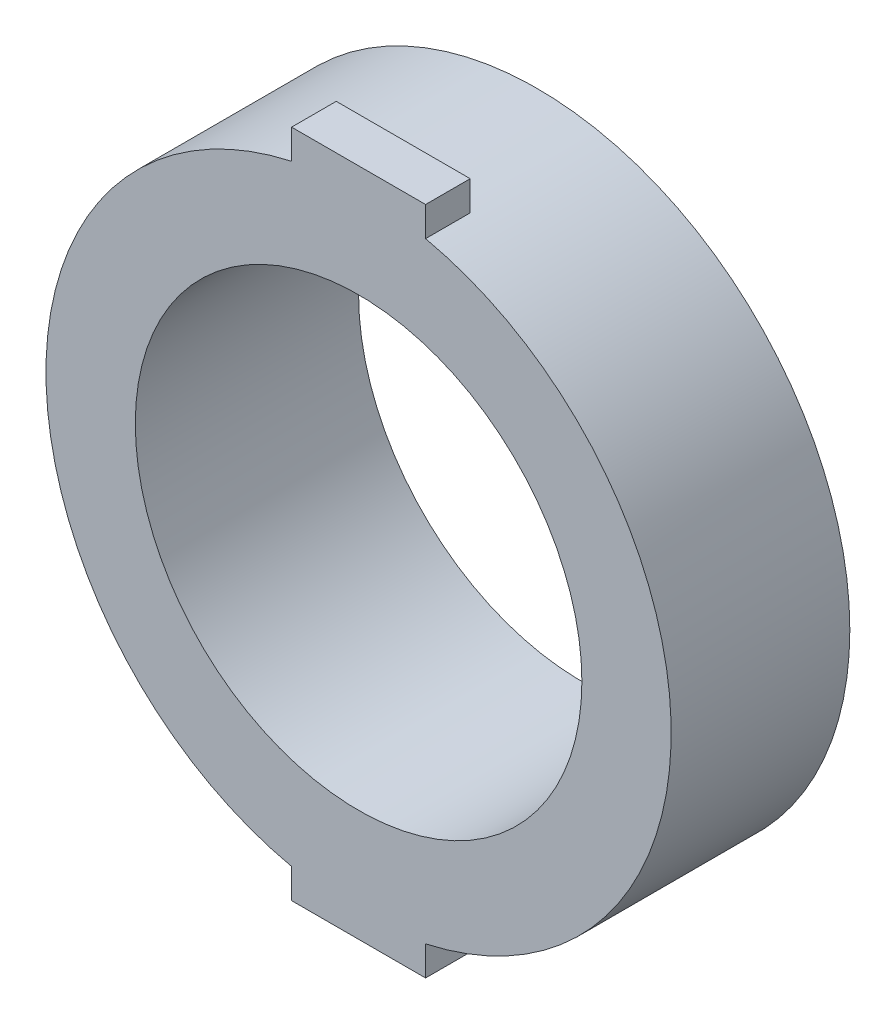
ISO-10303-21;
HEADER;
FILE_DESCRIPTION(('STEP AP214'),'2;1');
FILE_NAME('part.step','',(''),(''),'','','');
FILE_SCHEMA(('AUTOMOTIVE_DESIGN { 1 0 10303 214 1 1 1 1 }'));
ENDSEC;
DATA;
#1=APPLICATION_CONTEXT('core data for automotive mechanical design processes');
#2=APPLICATION_PROTOCOL_DEFINITION('international standard','automotive_design',2000,#1);
#3=PRODUCT_CONTEXT('',#1,'mechanical');
#4=PRODUCT('Part','Part','',(#3));
#5=PRODUCT_RELATED_PRODUCT_CATEGORY('part','',(#4));
#6=PRODUCT_DEFINITION_FORMATION('','',#4);
#7=PRODUCT_DEFINITION_CONTEXT('part definition',#1,'design');
#8=PRODUCT_DEFINITION('design','',#6,#7);
#9=PRODUCT_DEFINITION_SHAPE('','',#8);
#10=(LENGTH_UNIT() NAMED_UNIT(*) SI_UNIT(.MILLI.,.METRE.));
#11=(NAMED_UNIT(*) PLANE_ANGLE_UNIT() SI_UNIT($,.RADIAN.));
#12=(NAMED_UNIT(*) SI_UNIT($,.STERADIAN.) SOLID_ANGLE_UNIT());
#13=UNCERTAINTY_MEASURE_WITH_UNIT(LENGTH_MEASURE(1.E-05),#10,'distance_accuracy_value','');
#14=(GEOMETRIC_REPRESENTATION_CONTEXT(3) GLOBAL_UNCERTAINTY_ASSIGNED_CONTEXT((#13)) GLOBAL_UNIT_ASSIGNED_CONTEXT((#10,
#11,#12)) REPRESENTATION_CONTEXT('',''));
#15=CARTESIAN_POINT('',(0.,0.,0.));
#16=DIRECTION('',(0.,0.,1.));
#17=DIRECTION('',(1.,0.,0.));
#18=AXIS2_PLACEMENT_3D('',#15,#16,#17);
#19=CARTESIAN_POINT('',(0.,0.,0.));
#20=DIRECTION('',(0.,0.,1.));
#21=DIRECTION('',(1.,0.,0.));
#22=AXIS2_PLACEMENT_3D('',#19,#20,#21);
#23=PLANE('',#22);
#24=CARTESIAN_POINT('',(0.,0.,0.));
#25=DIRECTION('',(0.,0.,1.));
#26=DIRECTION('',(1.,0.,0.));
#27=AXIS2_PLACEMENT_3D('',#24,#25,#26);
#28=CIRCLE('',#27,7.);
#29=CARTESIAN_POINT('',(7.,0.,0.));
#30=VERTEX_POINT('',#29);
#31=EDGE_CURVE('E149',#30,#30,#28,.T.);
#32=ORIENTED_EDGE('',*,*,#31,.F.);
#33=EDGE_LOOP('',(#32));
#34=FACE_BOUND('',#33,.T.);
#35=CARTESIAN_POINT('',(0.,0.,0.));
#36=DIRECTION('',(0.,0.,1.));
#37=DIRECTION('',(1.,0.,0.));
#38=AXIS2_PLACEMENT_3D('',#35,#36,#37);
#39=CIRCLE('',#38,5.5);
#40=CARTESIAN_POINT('',(5.5,0.,0.));
#41=VERTEX_POINT('',#40);
#42=EDGE_CURVE('E11',#41,#41,#39,.F.);
#43=ORIENTED_EDGE('',*,*,#42,.F.);
#44=EDGE_LOOP('',(#43));
#45=FACE_BOUND('',#44,.T.);
#46=ADVANCED_FACE('F32',(#34,#45),#23,.F.);
#47=CARTESIAN_POINT('',(0.,0.,4.));
#48=DIRECTION('',(0.,0.,1.));
#49=DIRECTION('',(1.,0.,0.));
#50=AXIS2_PLACEMENT_3D('',#47,#48,#49);
#51=PLANE('',#50);
#52=CARTESIAN_POINT('',(0.,0.,4.));
#53=DIRECTION('',(0.,0.,1.));
#54=DIRECTION('',(1.,0.,0.));
#55=AXIS2_PLACEMENT_3D('',#52,#53,#54);
#56=CIRCLE('',#55,7.);
#57=CARTESIAN_POINT('',(-1.5,6.83739716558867,4.));
#58=VERTEX_POINT('',#57);
#59=CARTESIAN_POINT('',(-1.5,-6.83739716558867,4.));
#60=VERTEX_POINT('',#59);
#61=EDGE_CURVE('E103',#58,#60,#56,.T.);
#62=ORIENTED_EDGE('',*,*,#61,.T.);
#63=DIRECTION('',(0.,-1.,0.));
#64=VECTOR('',#63,1.);
#65=CARTESIAN_POINT('',(-1.5,-7.5,4.));
#66=LINE('',#65,#64);
#67=CARTESIAN_POINT('',(-1.5,-7.5,4.));
#68=VERTEX_POINT('',#67);
#69=EDGE_CURVE('E96',#60,#68,#66,.T.);
#70=ORIENTED_EDGE('',*,*,#69,.T.);
#71=DIRECTION('',(1.,0.,0.));
#72=VECTOR('',#71,1.);
#73=CARTESIAN_POINT('',(-1.5,-7.5,4.));
#74=LINE('',#73,#72);
#75=CARTESIAN_POINT('',(1.5,-7.5,4.));
#76=VERTEX_POINT('',#75);
#77=EDGE_CURVE('E101',#68,#76,#74,.T.);
#78=ORIENTED_EDGE('',*,*,#77,.T.);
#79=DIRECTION('',(0.,1.,0.));
#80=VECTOR('',#79,1.);
#81=CARTESIAN_POINT('',(1.49999999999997,-6.07506881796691,4.));
#82=LINE('',#81,#80);
#83=CARTESIAN_POINT('',(1.49999999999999,-6.83739716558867,4.));
#84=VERTEX_POINT('',#83);
#85=EDGE_CURVE('E47',#76,#84,#82,.T.);
#86=ORIENTED_EDGE('',*,*,#85,.T.);
#87=CARTESIAN_POINT('',(1.50000000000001,6.83739716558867,4.));
#88=VERTEX_POINT('',#87);
#89=EDGE_CURVE('E152',#84,#88,#56,.T.);
#90=ORIENTED_EDGE('',*,*,#89,.T.);
#91=DIRECTION('',(0.,1.,0.));
#92=VECTOR('',#91,1.);
#93=CARTESIAN_POINT('',(1.50000000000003,6.14530082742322,4.));
#94=LINE('',#93,#92);
#95=CARTESIAN_POINT('',(1.5,7.5,4.));
#96=VERTEX_POINT('',#95);
#97=EDGE_CURVE('E131',#88,#96,#94,.T.);
#98=ORIENTED_EDGE('',*,*,#97,.T.);
#99=DIRECTION('',(-1.,0.,0.));
#100=VECTOR('',#99,1.);
#101=CARTESIAN_POINT('',(-1.5,7.5,4.));
#102=LINE('',#101,#100);
#103=CARTESIAN_POINT('',(-1.5,7.5,4.));
#104=VERTEX_POINT('',#103);
#105=EDGE_CURVE('E127',#96,#104,#102,.T.);
#106=ORIENTED_EDGE('',*,*,#105,.T.);
#107=DIRECTION('',(0.,-1.,0.));
#108=VECTOR('',#107,1.);
#109=CARTESIAN_POINT('',(-1.5,7.5,4.));
#110=LINE('',#109,#108);
#111=EDGE_CURVE('E54',#104,#58,#110,.T.);
#112=ORIENTED_EDGE('',*,*,#111,.T.);
#113=EDGE_LOOP('',(#62,#70,#78,#86,#90,#98,#106,#112));
#114=FACE_BOUND('',#113,.T.);
#115=CARTESIAN_POINT('',(0.,0.,4.));
#116=DIRECTION('',(0.,0.,1.));
#117=DIRECTION('',(1.,0.,0.));
#118=AXIS2_PLACEMENT_3D('',#115,#116,#117);
#119=CIRCLE('',#118,5.);
#120=CARTESIAN_POINT('',(5.,0.,4.));
#121=VERTEX_POINT('',#120);
#122=EDGE_CURVE('E145',#121,#121,#119,.T.);
#123=ORIENTED_EDGE('',*,*,#122,.F.);
#124=EDGE_LOOP('',(#123));
#125=FACE_BOUND('',#124,.T.);
#126=ADVANCED_FACE('F98',(#114,#125),#51,.T.);
#127=CARTESIAN_POINT('',(0.,0.,4.));
#128=DIRECTION('',(0.,0.,-1.));
#129=DIRECTION('',(-1.,0.,0.));
#130=AXIS2_PLACEMENT_3D('',#127,#128,#129);
#131=CYLINDRICAL_SURFACE('',#130,7.);
#132=ORIENTED_EDGE('',*,*,#89,.F.);
#133=DIRECTION('',(0.,0.,-1.));
#134=VECTOR('',#133,1.);
#135=CARTESIAN_POINT('',(1.49999999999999,-6.83739716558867,4.));
#136=LINE('',#135,#134);
#137=CARTESIAN_POINT('',(1.49999999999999,-6.83739716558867,3.));
#138=VERTEX_POINT('',#137);
#139=EDGE_CURVE('E40',#84,#138,#136,.T.);
#140=ORIENTED_EDGE('',*,*,#139,.T.);
#141=CARTESIAN_POINT('',(0.,0.,3.));
#142=DIRECTION('',(0.,0.,1.));
#143=DIRECTION('',(1.,0.,0.));
#144=AXIS2_PLACEMENT_3D('',#141,#142,#143);
#145=CIRCLE('',#144,7.);
#146=CARTESIAN_POINT('',(-1.5,-6.83739716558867,3.));
#147=VERTEX_POINT('',#146);
#148=EDGE_CURVE('E163',#147,#138,#145,.T.);
#149=ORIENTED_EDGE('',*,*,#148,.F.);
#150=DIRECTION('',(0.,0.,-1.));
#151=VECTOR('',#150,1.);
#152=CARTESIAN_POINT('',(-1.5,-6.83739716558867,4.));
#153=LINE('',#152,#151);
#154=EDGE_CURVE('E165',#147,#60,#153,.F.);
#155=ORIENTED_EDGE('',*,*,#154,.T.);
#156=ORIENTED_EDGE('',*,*,#61,.F.);
#157=DIRECTION('',(0.,0.,-1.));
#158=VECTOR('',#157,1.);
#159=CARTESIAN_POINT('',(-1.5,6.83739716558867,4.));
#160=LINE('',#159,#158);
#161=CARTESIAN_POINT('',(-1.5,6.83739716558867,3.));
#162=VERTEX_POINT('',#161);
#163=EDGE_CURVE('E157',#58,#162,#160,.T.);
#164=ORIENTED_EDGE('',*,*,#163,.T.);
#165=CARTESIAN_POINT('',(0.,0.,3.));
#166=DIRECTION('',(0.,0.,-1.));
#167=DIRECTION('',(-1.,0.,0.));
#168=AXIS2_PLACEMENT_3D('',#165,#166,#167);
#169=CIRCLE('',#168,7.);
#170=CARTESIAN_POINT('',(1.50000000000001,6.83739716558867,3.));
#171=VERTEX_POINT('',#170);
#172=EDGE_CURVE('E154',#162,#171,#169,.T.);
#173=ORIENTED_EDGE('',*,*,#172,.T.);
#174=DIRECTION('',(0.,0.,-1.));
#175=VECTOR('',#174,1.);
#176=CARTESIAN_POINT('',(1.50000000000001,6.83739716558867,4.));
#177=LINE('',#176,#175);
#178=EDGE_CURVE('E160',#171,#88,#177,.F.);
#179=ORIENTED_EDGE('',*,*,#178,.T.);
#180=EDGE_LOOP('',(#132,#140,#149,#155,#156,#164,#173,#179));
#181=FACE_BOUND('',#180,.T.);
#182=ORIENTED_EDGE('',*,*,#31,.T.);
#183=EDGE_LOOP('',(#182));
#184=FACE_BOUND('',#183,.T.);
#185=ADVANCED_FACE('F34',(#181,#184),#131,.T.);
#186=CARTESIAN_POINT('',(0.,0.,4.));
#187=DIRECTION('',(0.,0.,-1.));
#188=DIRECTION('',(-1.,0.,0.));
#189=AXIS2_PLACEMENT_3D('',#186,#187,#188);
#190=CYLINDRICAL_SURFACE('',#189,5.);
#191=ORIENTED_EDGE('',*,*,#122,.T.);
#192=EDGE_LOOP('',(#191));
#193=FACE_BOUND('',#192,.T.);
#194=CARTESIAN_POINT('',(0.,0.,-1.));
#195=DIRECTION('',(0.,0.,-1.));
#196=DIRECTION('',(-1.,0.,0.));
#197=AXIS2_PLACEMENT_3D('',#194,#195,#196);
#198=CIRCLE('',#197,5.);
#199=CARTESIAN_POINT('',(-5.,0.,-1.));
#200=VERTEX_POINT('',#199);
#201=EDGE_CURVE('E273',#200,#200,#198,.T.);
#202=ORIENTED_EDGE('',*,*,#201,.T.);
#203=EDGE_LOOP('',(#202));
#204=FACE_BOUND('',#203,.T.);
#205=ADVANCED_FACE('F195',(#193,#204),#190,.F.);
#206=CARTESIAN_POINT('',(1.50000000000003,6.14530082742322,3.));
#207=DIRECTION('',(1.,0.,0.));
#208=DIRECTION('',(0.,1.,0.));
#209=AXIS2_PLACEMENT_3D('',#206,#207,#208);
#210=PLANE('',#209);
#211=ORIENTED_EDGE('',*,*,#178,.F.);
#212=DIRECTION('',(0.,1.,0.));
#213=VECTOR('',#212,1.);
#214=CARTESIAN_POINT('',(1.50000000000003,6.14530082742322,3.));
#215=LINE('',#214,#213);
#216=CARTESIAN_POINT('',(1.5,7.5,3.));
#217=VERTEX_POINT('',#216);
#218=EDGE_CURVE('E139',#171,#217,#215,.T.);
#219=ORIENTED_EDGE('',*,*,#218,.T.);
#220=DIRECTION('',(0.,0.,1.));
#221=VECTOR('',#220,1.);
#222=CARTESIAN_POINT('',(1.5,7.5,3.));
#223=LINE('',#222,#221);
#224=EDGE_CURVE('E142',#217,#96,#223,.T.);
#225=ORIENTED_EDGE('',*,*,#224,.T.);
#226=ORIENTED_EDGE('',*,*,#97,.F.);
#227=EDGE_LOOP('',(#211,#219,#225,#226));
#228=FACE_BOUND('',#227,.T.);
#229=ADVANCED_FACE('F198',(#228),#210,.T.);
#230=CARTESIAN_POINT('',(-1.5,7.5,3.));
#231=DIRECTION('',(-1.,0.,0.));
#232=DIRECTION('',(0.,0.,1.));
#233=AXIS2_PLACEMENT_3D('',#230,#231,#232);
#234=PLANE('',#233);
#235=ORIENTED_EDGE('',*,*,#163,.F.);
#236=ORIENTED_EDGE('',*,*,#111,.F.);
#237=DIRECTION('',(0.,0.,1.));
#238=VECTOR('',#237,1.);
#239=CARTESIAN_POINT('',(-1.5,7.5,3.));
#240=LINE('',#239,#238);
#241=CARTESIAN_POINT('',(-1.5,7.5,3.));
#242=VERTEX_POINT('',#241);
#243=EDGE_CURVE('E141',#242,#104,#240,.T.);
#244=ORIENTED_EDGE('',*,*,#243,.F.);
#245=DIRECTION('',(0.,-1.,0.));
#246=VECTOR('',#245,1.);
#247=CARTESIAN_POINT('',(-1.5,7.5,3.));
#248=LINE('',#247,#246);
#249=EDGE_CURVE('E136',#242,#162,#248,.T.);
#250=ORIENTED_EDGE('',*,*,#249,.T.);
#251=EDGE_LOOP('',(#235,#236,#244,#250));
#252=FACE_BOUND('',#251,.T.);
#253=ADVANCED_FACE('F205',(#252),#234,.T.);
#254=CARTESIAN_POINT('',(-1.5,7.5,3.));
#255=DIRECTION('',(0.,0.,-1.));
#256=DIRECTION('',(-1.,0.,0.));
#257=AXIS2_PLACEMENT_3D('',#254,#255,#256);
#258=PLANE('',#257);
#259=ORIENTED_EDGE('',*,*,#172,.F.);
#260=ORIENTED_EDGE('',*,*,#249,.F.);
#261=DIRECTION('',(-1.,0.,0.));
#262=VECTOR('',#261,1.);
#263=CARTESIAN_POINT('',(-1.5,7.5,3.));
#264=LINE('',#263,#262);
#265=EDGE_CURVE('E133',#217,#242,#264,.T.);
#266=ORIENTED_EDGE('',*,*,#265,.F.);
#267=ORIENTED_EDGE('',*,*,#218,.F.);
#268=EDGE_LOOP('',(#259,#260,#266,#267));
#269=FACE_BOUND('',#268,.T.);
#270=ADVANCED_FACE('F203',(#269),#258,.T.);
#271=CARTESIAN_POINT('',(-1.5,7.5,3.));
#272=DIRECTION('',(0.,1.,0.));
#273=DIRECTION('',(0.,0.,1.));
#274=AXIS2_PLACEMENT_3D('',#271,#272,#273);
#275=PLANE('',#274);
#276=ORIENTED_EDGE('',*,*,#105,.F.);
#277=ORIENTED_EDGE('',*,*,#224,.F.);
#278=ORIENTED_EDGE('',*,*,#265,.T.);
#279=ORIENTED_EDGE('',*,*,#243,.T.);
#280=EDGE_LOOP('',(#276,#277,#278,#279));
#281=FACE_BOUND('',#280,.T.);
#282=ADVANCED_FACE('F200',(#281),#275,.T.);
#283=CARTESIAN_POINT('',(1.49999999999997,-6.07506881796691,3.));
#284=DIRECTION('',(1.,0.,0.));
#285=DIRECTION('',(0.,1.,0.));
#286=AXIS2_PLACEMENT_3D('',#283,#284,#285);
#287=PLANE('',#286);
#288=ORIENTED_EDGE('',*,*,#139,.F.);
#289=ORIENTED_EDGE('',*,*,#85,.F.);
#290=DIRECTION('',(0.,0.,1.));
#291=VECTOR('',#290,1.);
#292=CARTESIAN_POINT('',(1.5,-7.5,3.));
#293=LINE('',#292,#291);
#294=CARTESIAN_POINT('',(1.5,-7.5,3.));
#295=VERTEX_POINT('',#294);
#296=EDGE_CURVE('E115',#295,#76,#293,.T.);
#297=ORIENTED_EDGE('',*,*,#296,.F.);
#298=DIRECTION('',(0.,1.,0.));
#299=VECTOR('',#298,1.);
#300=CARTESIAN_POINT('',(1.49999999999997,-6.07506881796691,3.));
#301=LINE('',#300,#299);
#302=EDGE_CURVE('E119',#295,#138,#301,.T.);
#303=ORIENTED_EDGE('',*,*,#302,.T.);
#304=EDGE_LOOP('',(#288,#289,#297,#303));
#305=FACE_BOUND('',#304,.T.);
#306=ADVANCED_FACE('F172',(#305),#287,.T.);
#307=CARTESIAN_POINT('',(-1.5,-7.5,3.));
#308=DIRECTION('',(-1.,0.,0.));
#309=DIRECTION('',(0.,0.,1.));
#310=AXIS2_PLACEMENT_3D('',#307,#308,#309);
#311=PLANE('',#310);
#312=ORIENTED_EDGE('',*,*,#154,.F.);
#313=DIRECTION('',(0.,-1.,0.));
#314=VECTOR('',#313,1.);
#315=CARTESIAN_POINT('',(-1.5,-7.5,3.));
#316=LINE('',#315,#314);
#317=CARTESIAN_POINT('',(-1.5,-7.5,3.));
#318=VERTEX_POINT('',#317);
#319=EDGE_CURVE('E111',#147,#318,#316,.T.);
#320=ORIENTED_EDGE('',*,*,#319,.T.);
#321=DIRECTION('',(0.,0.,1.));
#322=VECTOR('',#321,1.);
#323=CARTESIAN_POINT('',(-1.5,-7.5,3.));
#324=LINE('',#323,#322);
#325=EDGE_CURVE('E108',#318,#68,#324,.T.);
#326=ORIENTED_EDGE('',*,*,#325,.T.);
#327=ORIENTED_EDGE('',*,*,#69,.F.);
#328=EDGE_LOOP('',(#312,#320,#326,#327));
#329=FACE_BOUND('',#328,.T.);
#330=ADVANCED_FACE('F109',(#329),#311,.T.);
#331=CARTESIAN_POINT('',(1.5,-7.5,3.));
#332=DIRECTION('',(0.,0.,1.));
#333=DIRECTION('',(1.,0.,0.));
#334=AXIS2_PLACEMENT_3D('',#331,#332,#333);
#335=PLANE('',#334);
#336=ORIENTED_EDGE('',*,*,#319,.F.);
#337=ORIENTED_EDGE('',*,*,#148,.T.);
#338=ORIENTED_EDGE('',*,*,#302,.F.);
#339=DIRECTION('',(1.,0.,0.));
#340=VECTOR('',#339,1.);
#341=CARTESIAN_POINT('',(-1.5,-7.5,3.));
#342=LINE('',#341,#340);
#343=EDGE_CURVE('E116',#318,#295,#342,.T.);
#344=ORIENTED_EDGE('',*,*,#343,.F.);
#345=EDGE_LOOP('',(#336,#337,#338,#344));
#346=FACE_BOUND('',#345,.T.);
#347=ADVANCED_FACE('F175',(#346),#335,.F.);
#348=CARTESIAN_POINT('',(-1.5,-7.5,3.));
#349=DIRECTION('',(0.,-1.,0.));
#350=DIRECTION('',(0.,0.,-1.));
#351=AXIS2_PLACEMENT_3D('',#348,#349,#350);
#352=PLANE('',#351);
#353=ORIENTED_EDGE('',*,*,#77,.F.);
#354=ORIENTED_EDGE('',*,*,#325,.F.);
#355=ORIENTED_EDGE('',*,*,#343,.T.);
#356=ORIENTED_EDGE('',*,*,#296,.T.);
#357=EDGE_LOOP('',(#353,#354,#355,#356));
#358=FACE_BOUND('',#357,.T.);
#359=ADVANCED_FACE('F118',(#358),#352,.T.);
#360=CARTESIAN_POINT('',(0.,0.,-1.));
#361=DIRECTION('',(0.,0.,-1.));
#362=DIRECTION('',(-1.,0.,0.));
#363=AXIS2_PLACEMENT_3D('',#360,#361,#362);
#364=PLANE('',#363);
#365=CARTESIAN_POINT('',(0.,0.,-1.));
#366=DIRECTION('',(0.,0.,-1.));
#367=DIRECTION('',(-1.,0.,0.));
#368=AXIS2_PLACEMENT_3D('',#365,#366,#367);
#369=CIRCLE('',#368,5.5);
#370=CARTESIAN_POINT('',(-5.5,0.,-1.));
#371=VERTEX_POINT('',#370);
#372=EDGE_CURVE('E271',#371,#371,#369,.T.);
#373=ORIENTED_EDGE('',*,*,#372,.T.);
#374=EDGE_LOOP('',(#373));
#375=FACE_BOUND('',#374,.T.);
#376=ORIENTED_EDGE('',*,*,#201,.F.);
#377=EDGE_LOOP('',(#376));
#378=FACE_BOUND('',#377,.T.);
#379=ADVANCED_FACE('F182',(#375,#378),#364,.T.);
#380=CARTESIAN_POINT('',(0.,0.,-1.));
#381=DIRECTION('',(0.,0.,1.));
#382=DIRECTION('',(1.,0.,0.));
#383=AXIS2_PLACEMENT_3D('',#380,#381,#382);
#384=CYLINDRICAL_SURFACE('',#383,5.5);
#385=ORIENTED_EDGE('',*,*,#372,.F.);
#386=EDGE_LOOP('',(#385));
#387=FACE_BOUND('',#386,.T.);
#388=ORIENTED_EDGE('',*,*,#42,.T.);
#389=EDGE_LOOP('',(#388));
#390=FACE_BOUND('',#389,.T.);
#391=ADVANCED_FACE('F255',(#387,#390),#384,.T.);
#392=CLOSED_SHELL('',(#46,#126,#185,#205,#229,#253,#270,#282,#306,#330,#347,#359,#379,#391));
#393=MANIFOLD_SOLID_BREP('B2',#392);
#394=ADVANCED_BREP_SHAPE_REPRESENTATION('',(#18,#393),#14);
#395=SHAPE_DEFINITION_REPRESENTATION(#9,#394);
ENDSEC;
END-ISO-10303-21;
